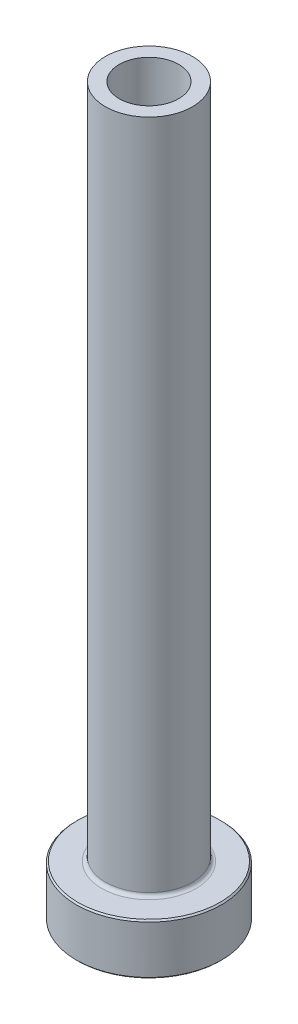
from build123d import *

# Parameters (mm, degrees)
FILLET1_R     = 0.5
CHAMFER1_SIZE = 0.2
CHAMFER3_SIZE = 0.5


with BuildPart() as part:
    # Sketch1 → Revolve1 (revolve)
    with BuildSketch(Plane.XY, mode=Mode.PRIVATE) as revolve1_sk:
        Polygon((-4.1, 100), (-6, 100), (-6, 7), (-10, 7), (-10, 0), (-4.35, 0), (-4.35, 43), (-4.1, 55), align=None)
    revolve(revolve1_sk.sketch.rotate(Axis((0, 92.187680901, 0), (0, -1, 0)), 270), axis=Axis((0, 92.187680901, 0), (0, -1, 0)))

    # Fillet1
    fillet1_edges = [part.edges().sort_by_distance(p)[0] for p in [
        (0, 7, -6),
    ]]
    fillet(fillet1_edges, radius=FILLET1_R)

    # Chamfer1
    chamfer1_edges = [part.edges().sort_by_distance(p)[0] for p in [
        (0, 0, -10),
        (0, 7, -10),
    ]]
    chamfer(chamfer1_edges, length=CHAMFER1_SIZE)

    # Chamfer3
    chamfer3_edges = [part.edges().sort_by_distance(p)[0] for p in [
        (0, 0, -4.35),
    ]]
    chamfer(chamfer3_edges, length=CHAMFER3_SIZE)


solid = part.part
